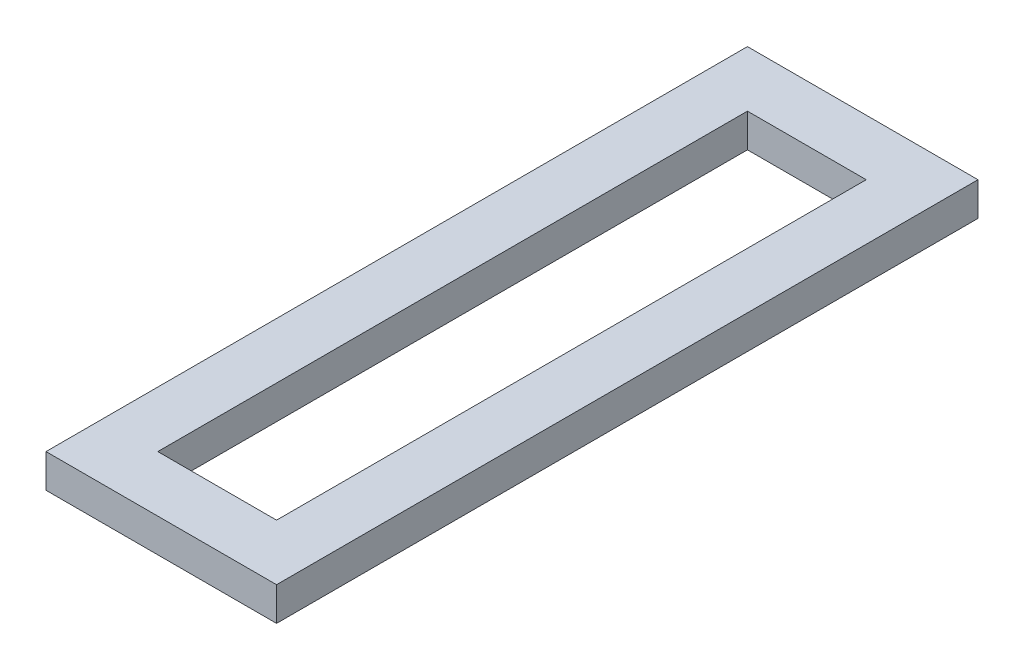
from build123d import *

# Parameters (mm, degrees)
SKETCH1_W           = 825
SKETCH1_H           = 2510
SKETCH1_W_2         = 425
SKETCH1_H_2         = 2110
BOSS_EXTRUDE1_DEPTH = 120
SKETCH5_W           = 805
SKETCH5_H           = 2490
SKETCH5_W_2         = 445
SKETCH5_H_2         = 2130
CUT_EXTRUDE1_DEPTH  = 100


with BuildPart() as part:
    # Sketch1 → Boss-Extrude1 (new body)
    with BuildSketch(Plane(origin=(0, 0, 0), x_dir=(1, 0, 0), z_dir=(0, 1, 0))):
        Rectangle(SKETCH1_W, SKETCH1_H)
        Rectangle(SKETCH1_W_2, SKETCH1_H_2, mode=Mode.SUBTRACT)
    extrude(amount=BOSS_EXTRUDE1_DEPTH)

    # Sketch5 → Cut-Extrude1 (cut)
    with BuildSketch(Plane(origin=(0, 10, 0), x_dir=(1, 0, 0), z_dir=(0, 1, 0))):
        Rectangle(SKETCH5_W, SKETCH5_H)
        Rectangle(SKETCH5_W_2, SKETCH5_H_2, mode=Mode.SUBTRACT)
    extrude(amount=CUT_EXTRUDE1_DEPTH, mode=Mode.SUBTRACT)


solid = part.part
